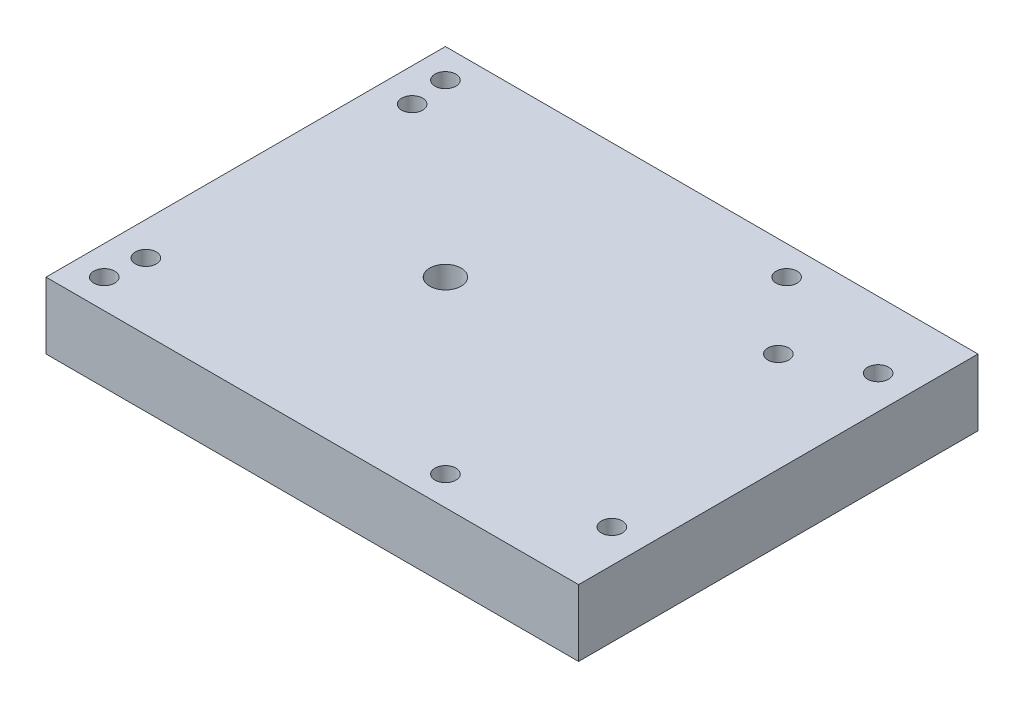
ISO-10303-21;
HEADER;
FILE_DESCRIPTION(('STEP AP214'),'2;1');
FILE_NAME('part.step','',(''),(''),'','','');
FILE_SCHEMA(('AUTOMOTIVE_DESIGN { 1 0 10303 214 1 1 1 1 }'));
ENDSEC;
DATA;
#1=APPLICATION_CONTEXT('core data for automotive mechanical design processes');
#2=APPLICATION_PROTOCOL_DEFINITION('international standard','automotive_design',2000,#1);
#3=PRODUCT_CONTEXT('',#1,'mechanical');
#4=PRODUCT('Part','Part','',(#3));
#5=PRODUCT_RELATED_PRODUCT_CATEGORY('part','',(#4));
#6=PRODUCT_DEFINITION_FORMATION('','',#4);
#7=PRODUCT_DEFINITION_CONTEXT('part definition',#1,'design');
#8=PRODUCT_DEFINITION('design','',#6,#7);
#9=PRODUCT_DEFINITION_SHAPE('','',#8);
#10=(LENGTH_UNIT() NAMED_UNIT(*) SI_UNIT(.MILLI.,.METRE.));
#11=(NAMED_UNIT(*) PLANE_ANGLE_UNIT() SI_UNIT($,.RADIAN.));
#12=(NAMED_UNIT(*) SI_UNIT($,.STERADIAN.) SOLID_ANGLE_UNIT());
#13=UNCERTAINTY_MEASURE_WITH_UNIT(LENGTH_MEASURE(1.E-05),#10,'distance_accuracy_value','');
#14=(GEOMETRIC_REPRESENTATION_CONTEXT(3) GLOBAL_UNCERTAINTY_ASSIGNED_CONTEXT((#13)) GLOBAL_UNIT_ASSIGNED_CONTEXT((#10,
#11,#12)) REPRESENTATION_CONTEXT('',''));
#15=CARTESIAN_POINT('',(0.,0.,0.));
#16=DIRECTION('',(0.,0.,1.));
#17=DIRECTION('',(1.,0.,0.));
#18=AXIS2_PLACEMENT_3D('',#15,#16,#17);
#19=CARTESIAN_POINT('',(-59.6394712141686,12.7,-26.8631045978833));
#20=DIRECTION('',(1.,0.,0.));
#21=DIRECTION('',(0.,0.,-1.));
#22=AXIS2_PLACEMENT_3D('',#19,#20,#21);
#23=PLANE('',#22);
#24=DIRECTION('',(0.,0.,1.));
#25=VECTOR('',#24,1.);
#26=CARTESIAN_POINT('',(-59.6394712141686,0.,-26.8631045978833));
#27=LINE('',#26,#25);
#28=CARTESIAN_POINT('',(-59.6394712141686,0.,-26.8631045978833));
#29=VERTEX_POINT('',#28);
#30=CARTESIAN_POINT('',(-59.6394712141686,0.,49.3368954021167));
#31=VERTEX_POINT('',#30);
#32=EDGE_CURVE('E96',#29,#31,#27,.T.);
#33=ORIENTED_EDGE('',*,*,#32,.T.);
#34=DIRECTION('',(0.,-1.,0.));
#35=VECTOR('',#34,1.);
#36=CARTESIAN_POINT('',(-59.6394712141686,12.7,49.3368954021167));
#37=LINE('',#36,#35);
#38=CARTESIAN_POINT('',(-59.6394712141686,12.7,49.3368954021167));
#39=VERTEX_POINT('',#38);
#40=EDGE_CURVE('E11',#39,#31,#37,.T.);
#41=ORIENTED_EDGE('',*,*,#40,.F.);
#42=DIRECTION('',(0.,0.,1.));
#43=VECTOR('',#42,1.);
#44=CARTESIAN_POINT('',(-59.6394712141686,12.7,-26.8631045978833));
#45=LINE('',#44,#43);
#46=CARTESIAN_POINT('',(-59.6394712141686,12.7,-26.8631045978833));
#47=VERTEX_POINT('',#46);
#48=EDGE_CURVE('E84',#47,#39,#45,.T.);
#49=ORIENTED_EDGE('',*,*,#48,.F.);
#50=DIRECTION('',(0.,-1.,0.));
#51=VECTOR('',#50,1.);
#52=CARTESIAN_POINT('',(-59.6394712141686,12.7,-26.8631045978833));
#53=LINE('',#52,#51);
#54=EDGE_CURVE('E92',#47,#29,#53,.T.);
#55=ORIENTED_EDGE('',*,*,#54,.T.);
#56=EDGE_LOOP('',(#33,#41,#49,#55));
#57=FACE_BOUND('',#56,.T.);
#58=ADVANCED_FACE('F33',(#57),#23,.F.);
#59=CARTESIAN_POINT('',(-59.6394712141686,12.7,49.3368954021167));
#60=DIRECTION('',(0.,0.,-1.));
#61=DIRECTION('',(-1.,0.,0.));
#62=AXIS2_PLACEMENT_3D('',#59,#60,#61);
#63=PLANE('',#62);
#64=DIRECTION('',(1.,0.,0.));
#65=VECTOR('',#64,1.);
#66=CARTESIAN_POINT('',(-59.6394712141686,0.,49.3368954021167));
#67=LINE('',#66,#65);
#68=CARTESIAN_POINT('',(41.9605287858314,0.,49.3368954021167));
#69=VERTEX_POINT('',#68);
#70=EDGE_CURVE('E88',#31,#69,#67,.T.);
#71=ORIENTED_EDGE('',*,*,#70,.T.);
#72=DIRECTION('',(0.,-1.,0.));
#73=VECTOR('',#72,1.);
#74=CARTESIAN_POINT('',(41.9605287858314,12.7,49.3368954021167));
#75=LINE('',#74,#73);
#76=CARTESIAN_POINT('',(41.9605287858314,12.7,49.3368954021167));
#77=VERTEX_POINT('',#76);
#78=EDGE_CURVE('E41',#77,#69,#75,.T.);
#79=ORIENTED_EDGE('',*,*,#78,.F.);
#80=DIRECTION('',(1.,0.,0.));
#81=VECTOR('',#80,1.);
#82=CARTESIAN_POINT('',(-59.6394712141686,12.7,49.3368954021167));
#83=LINE('',#82,#81);
#84=EDGE_CURVE('E79',#39,#77,#83,.T.);
#85=ORIENTED_EDGE('',*,*,#84,.F.);
#86=ORIENTED_EDGE('',*,*,#40,.T.);
#87=EDGE_LOOP('',(#71,#79,#85,#86));
#88=FACE_BOUND('',#87,.T.);
#89=ADVANCED_FACE('F87',(#88),#63,.F.);
#90=CARTESIAN_POINT('',(41.9605287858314,12.7,-26.8631045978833));
#91=DIRECTION('',(-1.,0.,0.));
#92=DIRECTION('',(0.,0.,1.));
#93=AXIS2_PLACEMENT_3D('',#90,#91,#92);
#94=PLANE('',#93);
#95=DIRECTION('',(0.,0.,-1.));
#96=VECTOR('',#95,1.);
#97=CARTESIAN_POINT('',(41.9605287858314,0.,-26.8631045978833));
#98=LINE('',#97,#96);
#99=CARTESIAN_POINT('',(41.9605287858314,0.,-26.8631045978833));
#100=VERTEX_POINT('',#99);
#101=EDGE_CURVE('E66',#69,#100,#98,.T.);
#102=ORIENTED_EDGE('',*,*,#101,.T.);
#103=DIRECTION('',(0.,-1.,0.));
#104=VECTOR('',#103,1.);
#105=CARTESIAN_POINT('',(41.9605287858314,12.7,-26.8631045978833));
#106=LINE('',#105,#104);
#107=CARTESIAN_POINT('',(41.9605287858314,12.7,-26.8631045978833));
#108=VERTEX_POINT('',#107);
#109=EDGE_CURVE('E89',#108,#100,#106,.T.);
#110=ORIENTED_EDGE('',*,*,#109,.F.);
#111=DIRECTION('',(0.,0.,-1.));
#112=VECTOR('',#111,1.);
#113=CARTESIAN_POINT('',(41.9605287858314,12.7,-26.8631045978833));
#114=LINE('',#113,#112);
#115=EDGE_CURVE('E82',#77,#108,#114,.T.);
#116=ORIENTED_EDGE('',*,*,#115,.F.);
#117=ORIENTED_EDGE('',*,*,#78,.T.);
#118=EDGE_LOOP('',(#102,#110,#116,#117));
#119=FACE_BOUND('',#118,.T.);
#120=ADVANCED_FACE('F90',(#119),#94,.F.);
#121=CARTESIAN_POINT('',(-59.6394712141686,12.7,-26.8631045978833));
#122=DIRECTION('',(0.,0.,1.));
#123=DIRECTION('',(1.,0.,0.));
#124=AXIS2_PLACEMENT_3D('',#121,#122,#123);
#125=PLANE('',#124);
#126=DIRECTION('',(-1.,0.,0.));
#127=VECTOR('',#126,1.);
#128=CARTESIAN_POINT('',(-59.6394712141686,0.,-26.8631045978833));
#129=LINE('',#128,#127);
#130=EDGE_CURVE('E72',#100,#29,#129,.T.);
#131=ORIENTED_EDGE('',*,*,#130,.T.);
#132=ORIENTED_EDGE('',*,*,#54,.F.);
#133=DIRECTION('',(-1.,0.,0.));
#134=VECTOR('',#133,1.);
#135=CARTESIAN_POINT('',(-59.6394712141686,12.7,-26.8631045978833));
#136=LINE('',#135,#134);
#137=EDGE_CURVE('E49',#108,#47,#136,.T.);
#138=ORIENTED_EDGE('',*,*,#137,.F.);
#139=ORIENTED_EDGE('',*,*,#109,.T.);
#140=EDGE_LOOP('',(#131,#132,#138,#139));
#141=FACE_BOUND('',#140,.T.);
#142=ADVANCED_FACE('F104',(#141),#125,.F.);
#143=CARTESIAN_POINT('',(-59.6394712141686,12.7,49.3368954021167));
#144=DIRECTION('',(0.,1.,0.));
#145=DIRECTION('',(0.,0.,1.));
#146=AXIS2_PLACEMENT_3D('',#143,#144,#145);
#147=PLANE('',#146);
#148=CARTESIAN_POINT('',(11.0042787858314,12.7,43.7806454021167));
#149=DIRECTION('',(0.,1.,0.));
#150=DIRECTION('',(0.,0.,1.));
#151=AXIS2_PLACEMENT_3D('',#148,#149,#150);
#152=CIRCLE('',#151,2.);
#153=CARTESIAN_POINT('',(11.0042787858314,12.7,45.7806454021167));
#154=VERTEX_POINT('',#153);
#155=EDGE_CURVE('E164',#154,#154,#152,.T.);
#156=ORIENTED_EDGE('',*,*,#155,.F.);
#157=EDGE_LOOP('',(#156));
#158=FACE_BOUND('',#157,.T.);
#159=CARTESIAN_POINT('',(-54.0832212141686,12.7,43.7806454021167));
#160=DIRECTION('',(0.,1.,0.));
#161=DIRECTION('',(0.,0.,1.));
#162=AXIS2_PLACEMENT_3D('',#159,#160,#161);
#163=CIRCLE('',#162,2.);
#164=CARTESIAN_POINT('',(-54.0832212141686,12.7,45.7806454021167));
#165=VERTEX_POINT('',#164);
#166=EDGE_CURVE('E158',#165,#165,#163,.T.);
#167=ORIENTED_EDGE('',*,*,#166,.F.);
#168=EDGE_LOOP('',(#167));
#169=FACE_BOUND('',#168,.T.);
#170=CARTESIAN_POINT('',(11.0042787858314,12.7,-21.3068545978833));
#171=DIRECTION('',(0.,1.,0.));
#172=DIRECTION('',(0.,0.,1.));
#173=AXIS2_PLACEMENT_3D('',#170,#171,#172);
#174=CIRCLE('',#173,2.);
#175=CARTESIAN_POINT('',(11.0042787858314,12.7,-19.3068545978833));
#176=VERTEX_POINT('',#175);
#177=EDGE_CURVE('E152',#176,#176,#174,.T.);
#178=ORIENTED_EDGE('',*,*,#177,.F.);
#179=EDGE_LOOP('',(#178));
#180=FACE_BOUND('',#179,.T.);
#181=CARTESIAN_POINT('',(-54.0832212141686,12.7,-21.3068545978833));
#182=DIRECTION('',(0.,1.,0.));
#183=DIRECTION('',(0.,0.,1.));
#184=AXIS2_PLACEMENT_3D('',#181,#182,#183);
#185=CIRCLE('',#184,2.);
#186=CARTESIAN_POINT('',(-54.0832212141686,12.7,-19.3068545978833));
#187=VERTEX_POINT('',#186);
#188=EDGE_CURVE('E146',#187,#187,#185,.T.);
#189=ORIENTED_EDGE('',*,*,#188,.F.);
#190=EDGE_LOOP('',(#189));
#191=FACE_BOUND('',#190,.T.);
#192=CARTESIAN_POINT('',(22.9105287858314,12.7,-7.8131045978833));
#193=DIRECTION('',(0.,1.,0.));
#194=DIRECTION('',(0.,0.,1.));
#195=AXIS2_PLACEMENT_3D('',#192,#193,#194);
#196=CIRCLE('',#195,2.00000000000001);
#197=CARTESIAN_POINT('',(22.9105287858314,12.7,-5.81310459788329));
#198=VERTEX_POINT('',#197);
#199=EDGE_CURVE('E140',#198,#198,#196,.T.);
#200=ORIENTED_EDGE('',*,*,#199,.F.);
#201=EDGE_LOOP('',(#200));
#202=FACE_BOUND('',#201,.T.);
#203=CARTESIAN_POINT('',(-53.2894712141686,12.7,36.6368954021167));
#204=DIRECTION('',(0.,1.,0.));
#205=DIRECTION('',(0.,0.,1.));
#206=AXIS2_PLACEMENT_3D('',#203,#204,#205);
#207=CIRCLE('',#206,2.);
#208=CARTESIAN_POINT('',(-53.2894712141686,12.7,38.6368954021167));
#209=VERTEX_POINT('',#208);
#210=EDGE_CURVE('E134',#209,#209,#207,.T.);
#211=ORIENTED_EDGE('',*,*,#210,.F.);
#212=EDGE_LOOP('',(#211));
#213=FACE_BOUND('',#212,.T.);
#214=CARTESIAN_POINT('',(35.6105287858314,12.7,36.6368954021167));
#215=DIRECTION('',(0.,1.,0.));
#216=DIRECTION('',(0.,0.,1.));
#217=AXIS2_PLACEMENT_3D('',#214,#215,#216);
#218=CIRCLE('',#217,2.);
#219=CARTESIAN_POINT('',(35.6105287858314,12.7,38.6368954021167));
#220=VERTEX_POINT('',#219);
#221=EDGE_CURVE('E128',#220,#220,#218,.T.);
#222=ORIENTED_EDGE('',*,*,#221,.F.);
#223=EDGE_LOOP('',(#222));
#224=FACE_BOUND('',#223,.T.);
#225=CARTESIAN_POINT('',(35.6105287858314,12.7,-14.1631045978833));
#226=DIRECTION('',(0.,1.,0.));
#227=DIRECTION('',(0.,0.,1.));
#228=AXIS2_PLACEMENT_3D('',#225,#226,#227);
#229=CIRCLE('',#228,2.);
#230=CARTESIAN_POINT('',(35.6105287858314,12.7,-12.1631045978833));
#231=VERTEX_POINT('',#230);
#232=EDGE_CURVE('E122',#231,#231,#229,.T.);
#233=ORIENTED_EDGE('',*,*,#232,.F.);
#234=EDGE_LOOP('',(#233));
#235=FACE_BOUND('',#234,.T.);
#236=CARTESIAN_POINT('',(-53.2894712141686,12.7,-14.1631045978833));
#237=DIRECTION('',(0.,1.,0.));
#238=DIRECTION('',(0.,0.,1.));
#239=AXIS2_PLACEMENT_3D('',#236,#237,#238);
#240=CIRCLE('',#239,2.);
#241=CARTESIAN_POINT('',(-53.2894712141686,12.7,-12.1631045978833));
#242=VERTEX_POINT('',#241);
#243=EDGE_CURVE('E116',#242,#242,#240,.T.);
#244=ORIENTED_EDGE('',*,*,#243,.F.);
#245=EDGE_LOOP('',(#244));
#246=FACE_BOUND('',#245,.T.);
#247=CARTESIAN_POINT('',(-21.5394712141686,12.7,11.2368954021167));
#248=DIRECTION('',(0.,1.,0.));
#249=DIRECTION('',(0.,0.,1.));
#250=AXIS2_PLACEMENT_3D('',#247,#248,#249);
#251=CIRCLE('',#250,3.);
#252=CARTESIAN_POINT('',(-21.5394712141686,12.7,14.2368954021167));
#253=VERTEX_POINT('',#252);
#254=EDGE_CURVE('E110',#253,#253,#251,.T.);
#255=ORIENTED_EDGE('',*,*,#254,.F.);
#256=EDGE_LOOP('',(#255));
#257=FACE_BOUND('',#256,.T.);
#258=ORIENTED_EDGE('',*,*,#48,.T.);
#259=ORIENTED_EDGE('',*,*,#84,.T.);
#260=ORIENTED_EDGE('',*,*,#115,.T.);
#261=ORIENTED_EDGE('',*,*,#137,.T.);
#262=EDGE_LOOP('',(#258,#259,#260,#261));
#263=FACE_BOUND('',#262,.T.);
#264=ADVANCED_FACE('F80',(#158,#169,#180,#191,#202,#213,#224,#235,#246,#257,#263),#147,.T.);
#265=CARTESIAN_POINT('',(-59.6394712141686,0.,49.3368954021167));
#266=DIRECTION('',(0.,1.,0.));
#267=DIRECTION('',(0.,0.,1.));
#268=AXIS2_PLACEMENT_3D('',#265,#266,#267);
#269=PLANE('',#268);
#270=CARTESIAN_POINT('',(22.9105287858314,0.,-7.8131045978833));
#271=DIRECTION('',(0.,1.,0.));
#272=DIRECTION('',(0.,0.,1.));
#273=AXIS2_PLACEMENT_3D('',#270,#271,#272);
#274=CIRCLE('',#273,2.00000000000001);
#275=CARTESIAN_POINT('',(22.9105287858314,0.,-5.81310459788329));
#276=VERTEX_POINT('',#275);
#277=EDGE_CURVE('E137',#276,#276,#274,.T.);
#278=ORIENTED_EDGE('',*,*,#277,.T.);
#279=EDGE_LOOP('',(#278));
#280=FACE_BOUND('',#279,.T.);
#281=CARTESIAN_POINT('',(-53.2894712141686,0.,36.6368954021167));
#282=DIRECTION('',(0.,1.,0.));
#283=DIRECTION('',(0.,0.,1.));
#284=AXIS2_PLACEMENT_3D('',#281,#282,#283);
#285=CIRCLE('',#284,2.);
#286=CARTESIAN_POINT('',(-53.2894712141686,0.,38.6368954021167));
#287=VERTEX_POINT('',#286);
#288=EDGE_CURVE('E131',#287,#287,#285,.T.);
#289=ORIENTED_EDGE('',*,*,#288,.T.);
#290=EDGE_LOOP('',(#289));
#291=FACE_BOUND('',#290,.T.);
#292=CARTESIAN_POINT('',(35.6105287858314,0.,36.6368954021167));
#293=DIRECTION('',(0.,1.,0.));
#294=DIRECTION('',(0.,0.,1.));
#295=AXIS2_PLACEMENT_3D('',#292,#293,#294);
#296=CIRCLE('',#295,2.);
#297=CARTESIAN_POINT('',(35.6105287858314,0.,38.6368954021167));
#298=VERTEX_POINT('',#297);
#299=EDGE_CURVE('E125',#298,#298,#296,.T.);
#300=ORIENTED_EDGE('',*,*,#299,.T.);
#301=EDGE_LOOP('',(#300));
#302=FACE_BOUND('',#301,.T.);
#303=CARTESIAN_POINT('',(35.6105287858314,0.,-14.1631045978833));
#304=DIRECTION('',(0.,1.,0.));
#305=DIRECTION('',(0.,0.,1.));
#306=AXIS2_PLACEMENT_3D('',#303,#304,#305);
#307=CIRCLE('',#306,2.);
#308=CARTESIAN_POINT('',(35.6105287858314,0.,-12.1631045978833));
#309=VERTEX_POINT('',#308);
#310=EDGE_CURVE('E119',#309,#309,#307,.T.);
#311=ORIENTED_EDGE('',*,*,#310,.T.);
#312=EDGE_LOOP('',(#311));
#313=FACE_BOUND('',#312,.T.);
#314=CARTESIAN_POINT('',(-53.2894712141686,0.,-14.1631045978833));
#315=DIRECTION('',(0.,1.,0.));
#316=DIRECTION('',(0.,0.,1.));
#317=AXIS2_PLACEMENT_3D('',#314,#315,#316);
#318=CIRCLE('',#317,2.);
#319=CARTESIAN_POINT('',(-53.2894712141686,0.,-12.1631045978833));
#320=VERTEX_POINT('',#319);
#321=EDGE_CURVE('E113',#320,#320,#318,.T.);
#322=ORIENTED_EDGE('',*,*,#321,.T.);
#323=EDGE_LOOP('',(#322));
#324=FACE_BOUND('',#323,.T.);
#325=CARTESIAN_POINT('',(-21.5394712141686,0.,11.2368954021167));
#326=DIRECTION('',(0.,1.,0.));
#327=DIRECTION('',(0.,0.,1.));
#328=AXIS2_PLACEMENT_3D('',#325,#326,#327);
#329=CIRCLE('',#328,3.);
#330=CARTESIAN_POINT('',(-21.5394712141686,0.,14.2368954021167));
#331=VERTEX_POINT('',#330);
#332=EDGE_CURVE('E99',#331,#331,#329,.T.);
#333=ORIENTED_EDGE('',*,*,#332,.T.);
#334=EDGE_LOOP('',(#333));
#335=FACE_BOUND('',#334,.T.);
#336=ORIENTED_EDGE('',*,*,#32,.F.);
#337=ORIENTED_EDGE('',*,*,#130,.F.);
#338=ORIENTED_EDGE('',*,*,#101,.F.);
#339=ORIENTED_EDGE('',*,*,#70,.F.);
#340=EDGE_LOOP('',(#336,#337,#338,#339));
#341=FACE_BOUND('',#340,.T.);
#342=ADVANCED_FACE('F107',(#280,#291,#302,#313,#324,#335,#341),#269,.F.);
#343=CARTESIAN_POINT('',(-21.5394712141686,0.,11.2368954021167));
#344=DIRECTION('',(0.,1.,0.));
#345=DIRECTION('',(0.,0.,1.));
#346=AXIS2_PLACEMENT_3D('',#343,#344,#345);
#347=CYLINDRICAL_SURFACE('',#346,3.);
#348=ORIENTED_EDGE('',*,*,#332,.F.);
#349=EDGE_LOOP('',(#348));
#350=FACE_BOUND('',#349,.T.);
#351=ORIENTED_EDGE('',*,*,#254,.T.);
#352=EDGE_LOOP('',(#351));
#353=FACE_BOUND('',#352,.T.);
#354=ADVANCED_FACE('F200',(#350,#353),#347,.F.);
#355=CARTESIAN_POINT('',(-53.2894712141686,0.,-14.1631045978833));
#356=DIRECTION('',(0.,1.,0.));
#357=DIRECTION('',(0.,0.,1.));
#358=AXIS2_PLACEMENT_3D('',#355,#356,#357);
#359=CYLINDRICAL_SURFACE('',#358,2.);
#360=ORIENTED_EDGE('',*,*,#321,.F.);
#361=EDGE_LOOP('',(#360));
#362=FACE_BOUND('',#361,.T.);
#363=ORIENTED_EDGE('',*,*,#243,.T.);
#364=EDGE_LOOP('',(#363));
#365=FACE_BOUND('',#364,.T.);
#366=ADVANCED_FACE('F202',(#362,#365),#359,.F.);
#367=CARTESIAN_POINT('',(35.6105287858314,0.,-14.1631045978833));
#368=DIRECTION('',(0.,1.,0.));
#369=DIRECTION('',(0.,0.,1.));
#370=AXIS2_PLACEMENT_3D('',#367,#368,#369);
#371=CYLINDRICAL_SURFACE('',#370,2.);
#372=ORIENTED_EDGE('',*,*,#310,.F.);
#373=EDGE_LOOP('',(#372));
#374=FACE_BOUND('',#373,.T.);
#375=ORIENTED_EDGE('',*,*,#232,.T.);
#376=EDGE_LOOP('',(#375));
#377=FACE_BOUND('',#376,.T.);
#378=ADVANCED_FACE('F209',(#374,#377),#371,.F.);
#379=CARTESIAN_POINT('',(35.6105287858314,0.,36.6368954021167));
#380=DIRECTION('',(0.,1.,0.));
#381=DIRECTION('',(0.,0.,1.));
#382=AXIS2_PLACEMENT_3D('',#379,#380,#381);
#383=CYLINDRICAL_SURFACE('',#382,2.);
#384=ORIENTED_EDGE('',*,*,#299,.F.);
#385=EDGE_LOOP('',(#384));
#386=FACE_BOUND('',#385,.T.);
#387=ORIENTED_EDGE('',*,*,#221,.T.);
#388=EDGE_LOOP('',(#387));
#389=FACE_BOUND('',#388,.T.);
#390=ADVANCED_FACE('F335',(#386,#389),#383,.F.);
#391=CARTESIAN_POINT('',(-53.2894712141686,0.,36.6368954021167));
#392=DIRECTION('',(0.,1.,0.));
#393=DIRECTION('',(0.,0.,1.));
#394=AXIS2_PLACEMENT_3D('',#391,#392,#393);
#395=CYLINDRICAL_SURFACE('',#394,2.);
#396=ORIENTED_EDGE('',*,*,#288,.F.);
#397=EDGE_LOOP('',(#396));
#398=FACE_BOUND('',#397,.T.);
#399=ORIENTED_EDGE('',*,*,#210,.T.);
#400=EDGE_LOOP('',(#399));
#401=FACE_BOUND('',#400,.T.);
#402=ADVANCED_FACE('F245',(#398,#401),#395,.F.);
#403=CARTESIAN_POINT('',(22.9105287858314,0.,-7.8131045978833));
#404=DIRECTION('',(0.,1.,0.));
#405=DIRECTION('',(0.,0.,1.));
#406=AXIS2_PLACEMENT_3D('',#403,#404,#405);
#407=CYLINDRICAL_SURFACE('',#406,2.00000000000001);
#408=ORIENTED_EDGE('',*,*,#277,.F.);
#409=EDGE_LOOP('',(#408));
#410=FACE_BOUND('',#409,.T.);
#411=ORIENTED_EDGE('',*,*,#199,.T.);
#412=EDGE_LOOP('',(#411));
#413=FACE_BOUND('',#412,.T.);
#414=ADVANCED_FACE('F250',(#410,#413),#407,.F.);
#415=CARTESIAN_POINT('',(-54.0832212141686,6.35,-21.3068545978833));
#416=DIRECTION('',(0.,1.,0.));
#417=DIRECTION('',(0.,0.,1.));
#418=AXIS2_PLACEMENT_3D('',#415,#416,#417);
#419=CYLINDRICAL_SURFACE('',#418,2.);
#420=CARTESIAN_POINT('',(-54.0832212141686,6.35,-21.3068545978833));
#421=DIRECTION('',(0.,1.,0.));
#422=DIRECTION('',(0.,0.,1.));
#423=AXIS2_PLACEMENT_3D('',#420,#421,#422);
#424=CIRCLE('',#423,2.);
#425=CARTESIAN_POINT('',(-54.0832212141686,6.35,-19.3068545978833));
#426=VERTEX_POINT('',#425);
#427=EDGE_CURVE('E143',#426,#426,#424,.T.);
#428=ORIENTED_EDGE('',*,*,#427,.F.);
#429=EDGE_LOOP('',(#428));
#430=FACE_BOUND('',#429,.T.);
#431=ORIENTED_EDGE('',*,*,#188,.T.);
#432=EDGE_LOOP('',(#431));
#433=FACE_BOUND('',#432,.T.);
#434=ADVANCED_FACE('F254',(#430,#433),#419,.F.);
#435=CARTESIAN_POINT('',(-54.0832212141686,6.35,-21.3068545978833));
#436=DIRECTION('',(0.,1.,0.));
#437=DIRECTION('',(0.,0.,1.));
#438=AXIS2_PLACEMENT_3D('',#435,#436,#437);
#439=PLANE('',#438);
#440=ORIENTED_EDGE('',*,*,#427,.T.);
#441=EDGE_LOOP('',(#440));
#442=FACE_BOUND('',#441,.T.);
#443=ADVANCED_FACE('F266',(#442),#439,.T.);
#444=CARTESIAN_POINT('',(11.0042787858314,6.35,-21.3068545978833));
#445=DIRECTION('',(0.,1.,0.));
#446=DIRECTION('',(0.,0.,1.));
#447=AXIS2_PLACEMENT_3D('',#444,#445,#446);
#448=CYLINDRICAL_SURFACE('',#447,2.);
#449=CARTESIAN_POINT('',(11.0042787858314,6.35,-21.3068545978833));
#450=DIRECTION('',(0.,1.,0.));
#451=DIRECTION('',(0.,0.,1.));
#452=AXIS2_PLACEMENT_3D('',#449,#450,#451);
#453=CIRCLE('',#452,2.);
#454=CARTESIAN_POINT('',(11.0042787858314,6.35,-19.3068545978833));
#455=VERTEX_POINT('',#454);
#456=EDGE_CURVE('E149',#455,#455,#453,.T.);
#457=ORIENTED_EDGE('',*,*,#456,.F.);
#458=EDGE_LOOP('',(#457));
#459=FACE_BOUND('',#458,.T.);
#460=ORIENTED_EDGE('',*,*,#177,.T.);
#461=EDGE_LOOP('',(#460));
#462=FACE_BOUND('',#461,.T.);
#463=ADVANCED_FACE('F273',(#459,#462),#448,.F.);
#464=CARTESIAN_POINT('',(11.0042787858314,6.35,-21.3068545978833));
#465=DIRECTION('',(0.,1.,0.));
#466=DIRECTION('',(0.,0.,1.));
#467=AXIS2_PLACEMENT_3D('',#464,#465,#466);
#468=PLANE('',#467);
#469=ORIENTED_EDGE('',*,*,#456,.T.);
#470=EDGE_LOOP('',(#469));
#471=FACE_BOUND('',#470,.T.);
#472=ADVANCED_FACE('F281',(#471),#468,.T.);
#473=CARTESIAN_POINT('',(-54.0832212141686,6.35,43.7806454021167));
#474=DIRECTION('',(0.,1.,0.));
#475=DIRECTION('',(0.,0.,1.));
#476=AXIS2_PLACEMENT_3D('',#473,#474,#475);
#477=CYLINDRICAL_SURFACE('',#476,2.);
#478=CARTESIAN_POINT('',(-54.0832212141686,6.35,43.7806454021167));
#479=DIRECTION('',(0.,1.,0.));
#480=DIRECTION('',(0.,0.,1.));
#481=AXIS2_PLACEMENT_3D('',#478,#479,#480);
#482=CIRCLE('',#481,2.);
#483=CARTESIAN_POINT('',(-54.0832212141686,6.35,45.7806454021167));
#484=VERTEX_POINT('',#483);
#485=EDGE_CURVE('E155',#484,#484,#482,.T.);
#486=ORIENTED_EDGE('',*,*,#485,.F.);
#487=EDGE_LOOP('',(#486));
#488=FACE_BOUND('',#487,.T.);
#489=ORIENTED_EDGE('',*,*,#166,.T.);
#490=EDGE_LOOP('',(#489));
#491=FACE_BOUND('',#490,.T.);
#492=ADVANCED_FACE('F289',(#488,#491),#477,.F.);
#493=CARTESIAN_POINT('',(-54.0832212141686,6.35,43.7806454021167));
#494=DIRECTION('',(0.,1.,0.));
#495=DIRECTION('',(0.,0.,1.));
#496=AXIS2_PLACEMENT_3D('',#493,#494,#495);
#497=PLANE('',#496);
#498=ORIENTED_EDGE('',*,*,#485,.T.);
#499=EDGE_LOOP('',(#498));
#500=FACE_BOUND('',#499,.T.);
#501=ADVANCED_FACE('F175',(#500),#497,.T.);
#502=CARTESIAN_POINT('',(11.0042787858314,6.35,43.7806454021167));
#503=DIRECTION('',(0.,1.,0.));
#504=DIRECTION('',(0.,0.,1.));
#505=AXIS2_PLACEMENT_3D('',#502,#503,#504);
#506=CYLINDRICAL_SURFACE('',#505,2.);
#507=CARTESIAN_POINT('',(11.0042787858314,6.35,43.7806454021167));
#508=DIRECTION('',(0.,1.,0.));
#509=DIRECTION('',(0.,0.,1.));
#510=AXIS2_PLACEMENT_3D('',#507,#508,#509);
#511=CIRCLE('',#510,2.);
#512=CARTESIAN_POINT('',(11.0042787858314,6.35,45.7806454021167));
#513=VERTEX_POINT('',#512);
#514=EDGE_CURVE('E161',#513,#513,#511,.T.);
#515=ORIENTED_EDGE('',*,*,#514,.F.);
#516=EDGE_LOOP('',(#515));
#517=FACE_BOUND('',#516,.T.);
#518=ORIENTED_EDGE('',*,*,#155,.T.);
#519=EDGE_LOOP('',(#518));
#520=FACE_BOUND('',#519,.T.);
#521=ADVANCED_FACE('F172',(#517,#520),#506,.F.);
#522=CARTESIAN_POINT('',(11.0042787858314,6.35,43.7806454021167));
#523=DIRECTION('',(0.,1.,0.));
#524=DIRECTION('',(0.,0.,1.));
#525=AXIS2_PLACEMENT_3D('',#522,#523,#524);
#526=PLANE('',#525);
#527=ORIENTED_EDGE('',*,*,#514,.T.);
#528=EDGE_LOOP('',(#527));
#529=FACE_BOUND('',#528,.T.);
#530=ADVANCED_FACE('F170',(#529),#526,.T.);
#531=CLOSED_SHELL('',(#58,#89,#120,#142,#264,#342,#354,#366,#378,#390,#402,#414,#434,#443,#463,
#472,#492,#501,#521,#530));
#532=MANIFOLD_SOLID_BREP('B2',#531);
#533=ADVANCED_BREP_SHAPE_REPRESENTATION('',(#18,#532),#14);
#534=SHAPE_DEFINITION_REPRESENTATION(#9,#533);
ENDSEC;
END-ISO-10303-21;
